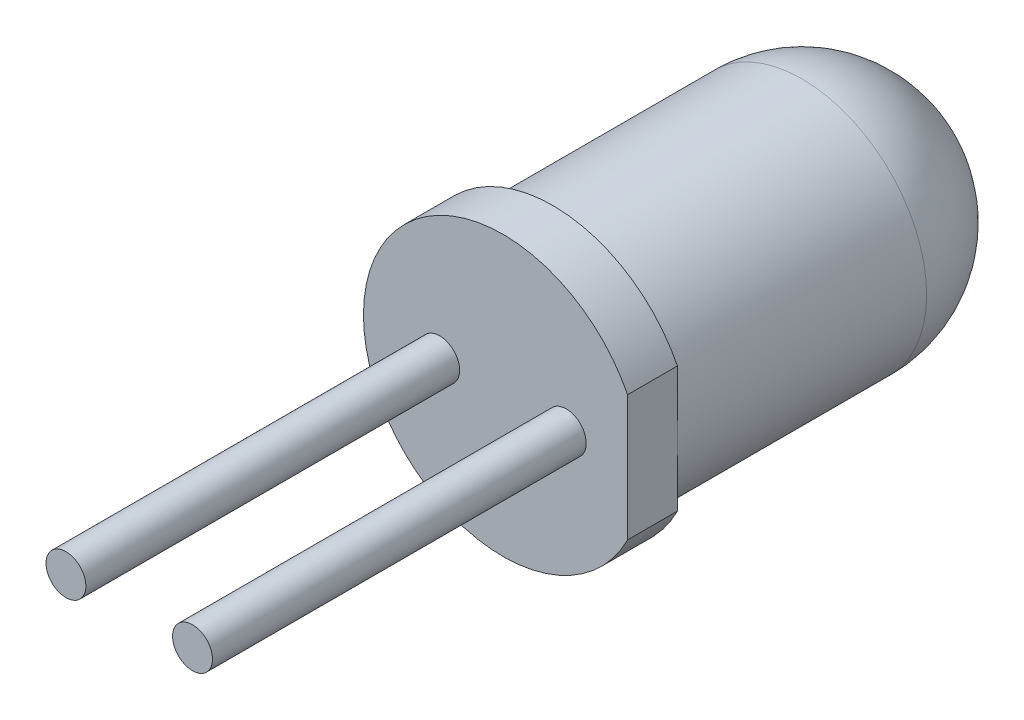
from build123d import *

# Parameters (mm, degrees)
ESQUISSE1_R          = 2.5
BASE_EXTRUSION_DEPTH = 8.5
BOSS_EXTRU_1_DEPTH   = 1
CONG_1_R             = 2.5
ESQUISSE3_R          = 0.4
EXTRUSION1_DEPTH     = 7.5


with BuildPart() as part:
    # Esquisse1 → Base-Extrusion (new body)
    with BuildSketch(Plane.XY):
        Circle(ESQUISSE1_R)
    extrude(amount=BASE_EXTRUSION_DEPTH)

    # Esquisse2 → Boss.-Extru.1 (add)
    with BuildSketch(Plane.XY.offset(8.5)):
        with BuildLine():
            Line((2.5, 1.260952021), (2.5, -1.260952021))
            ThreePointArc((2.5, -1.260952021), (-2.8, 0), (2.5, 1.260952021))
        make_face()
    extrude(amount=-BOSS_EXTRU_1_DEPTH)

    # Cong_1
    cong_1_edges = [part.edges().sort_by_distance(p)[0] for p in [
        (-2.5, 0, 0),
    ]]
    fillet(cong_1_edges, radius=CONG_1_R)

    # Esquisse3 → Extrusion1 (add)
    with BuildSketch(Plane.XY.offset(8.5)):
        with Locations((1.27, 0)):
            Circle(ESQUISSE3_R)
        with Locations(Location((-1.27, 0, 0), (0, 0, 180))):
            Circle(ESQUISSE3_R)
    extrude(amount=EXTRUSION1_DEPTH)


solid = part.part
